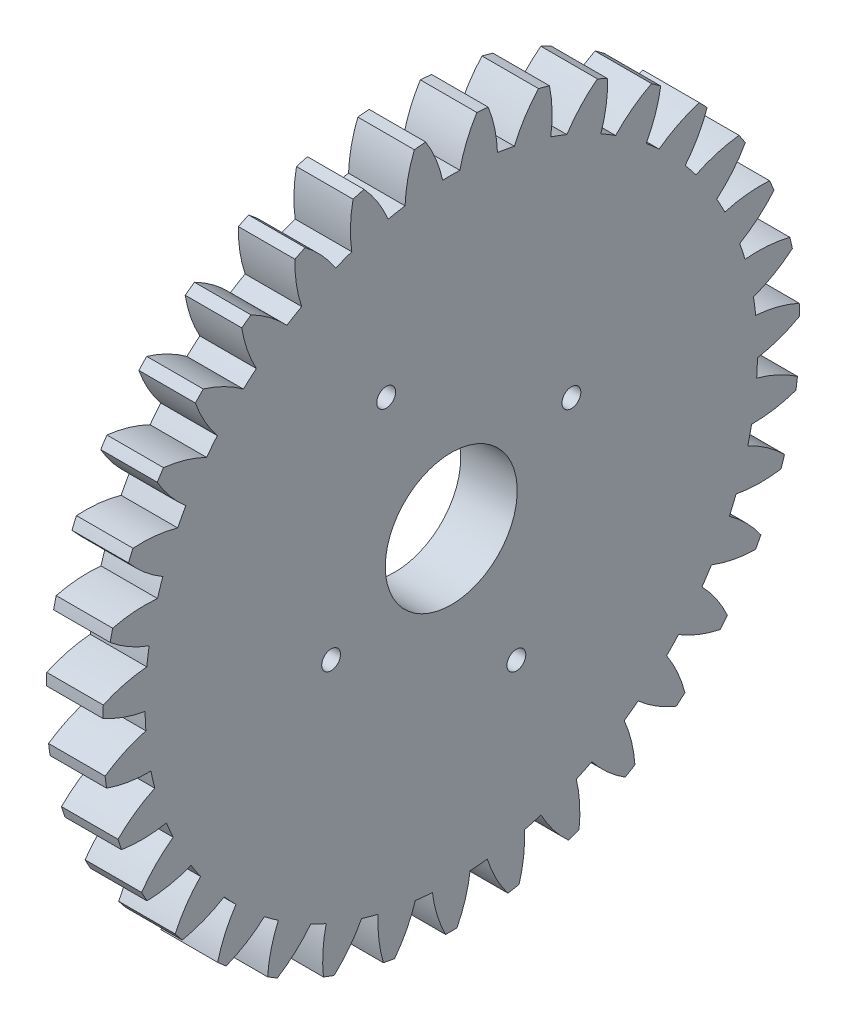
from build123d import *

# Parameters (mm, degrees)
BASPROSKE_W                     = 3
BASPROSKE_H                     = 18.5
TOOTHCUT_DEPTH                  = 27.334388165
TEETHCUTS_COUNT                 = 35
TEETHCUTS_ANGLE                 = 349.714285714
BORSKE_R                        = 3.5
BORE_DEPTH                      = 50.0000508
F_1_0MM_CLEARANCE_DOWEL_HOLE1_D = 1


with BuildPart() as part:
    # BasProSke → Base-Revolve (revolve)
    with BuildSketch(Plane(origin=(0, 0, 0), x_dir=(1, 0, 0), z_dir=(0, 1, 0)), mode=Mode.PRIVATE) as base_revolve_sk:
        with Locations((1.5, 9.25)):
            Rectangle(BASPROSKE_W, BASPROSKE_H)
    revolve(base_revolve_sk.sketch.rotate(Axis((-10, 0, 0), (1, 0, 0)), 180), axis=Axis((-10, 0, 0), (1, 0, 0)))

    # TooCutSke → ToothCut (cut, through all)
    with BuildSketch(Plane(origin=(0, 0, 0), x_dir=(0, 0, -1), z_dir=(1, 0, 0))):
        with BuildLine():
            ThreePointArc((0.456361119, 16.242590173), (0, 16.249), (-0.456361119, 16.242590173))
            ThreePointArc((-0.456361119, 16.242590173), (-0.817781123, 17.39831105), (-1.372969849, 18.474452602))
            ThreePointArc((-1.372969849, 18.474452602), (0, 18.5254), (1.372969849, 18.474452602))
            ThreePointArc((1.372969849, 18.474452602), (0.817781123, 17.39831105), (0.456361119, 16.242590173))
        make_face()
    toothcut = extrude(amount=TOOTHCUT_DEPTH, mode=Mode.SUBTRACT)

    # TeethCuts: ToothCut ×35 about axis
    teethcuts_axis = Axis((-10, 0, 0), (1, 0, 0))
    for i in range(1, TEETHCUTS_COUNT):
        add(toothcut.rotate(teethcuts_axis, i * TEETHCUTS_ANGLE / (TEETHCUTS_COUNT - 1)), mode=Mode.SUBTRACT)

    # BorSke → Bore (cut, symmetric)
    with BuildSketch(Plane(origin=(0, 0, 0), x_dir=(0, 0, -1), z_dir=(1, 0, 0))):
        with Locations(Location((0, 0, 0), (0, 0, 180))):
            Circle(BORSKE_R)
    extrude(amount=BORE_DEPTH, both=True, mode=Mode.SUBTRACT)

    # 1.0mm Clearance Dowel Hole1 (through all)
    with Locations(Plane(origin=(3, 14.520538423, -34.574614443), x_dir=(0, 0.9219897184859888, 0.38721435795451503), z_dir=(1, 0, 0))):
        with Locations((-0.146292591, 44.476161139), (8.498131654, 37.678208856), (0.146292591, 30.523838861), (-8.498131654, 37.321791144)):
            Hole(F_1_0MM_CLEARANCE_DOWEL_HOLE1_D / 2)


solid = part.part
